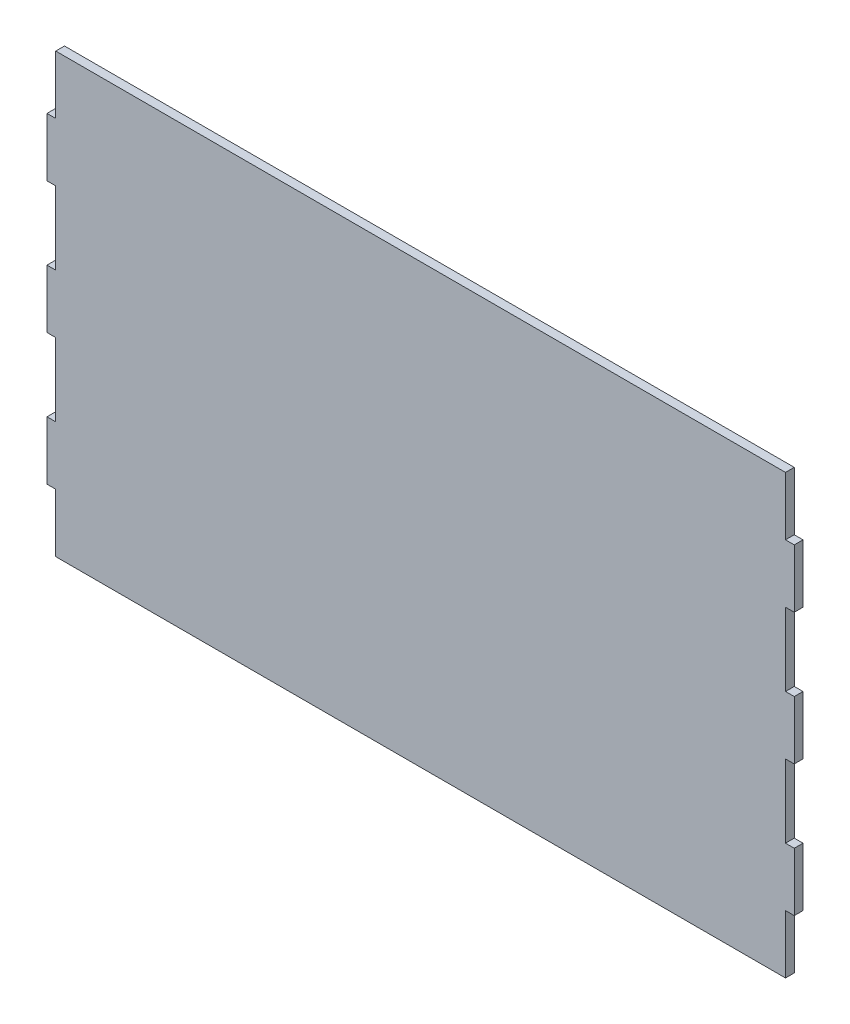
ISO-10303-21;
HEADER;
FILE_DESCRIPTION(('STEP AP214'),'2;1');
FILE_NAME('part.step','',(''),(''),'','','');
FILE_SCHEMA(('AUTOMOTIVE_DESIGN { 1 0 10303 214 1 1 1 1 }'));
ENDSEC;
DATA;
#1=APPLICATION_CONTEXT('core data for automotive mechanical design processes');
#2=APPLICATION_PROTOCOL_DEFINITION('international standard','automotive_design',2000,#1);
#3=PRODUCT_CONTEXT('',#1,'mechanical');
#4=PRODUCT('Part','Part','',(#3));
#5=PRODUCT_RELATED_PRODUCT_CATEGORY('part','',(#4));
#6=PRODUCT_DEFINITION_FORMATION('','',#4);
#7=PRODUCT_DEFINITION_CONTEXT('part definition',#1,'design');
#8=PRODUCT_DEFINITION('design','',#6,#7);
#9=PRODUCT_DEFINITION_SHAPE('','',#8);
#10=(LENGTH_UNIT() NAMED_UNIT(*) SI_UNIT(.MILLI.,.METRE.));
#11=(NAMED_UNIT(*) PLANE_ANGLE_UNIT() SI_UNIT($,.RADIAN.));
#12=(NAMED_UNIT(*) SI_UNIT($,.STERADIAN.) SOLID_ANGLE_UNIT());
#13=UNCERTAINTY_MEASURE_WITH_UNIT(LENGTH_MEASURE(1.E-05),#10,'distance_accuracy_value','');
#14=(GEOMETRIC_REPRESENTATION_CONTEXT(3) GLOBAL_UNCERTAINTY_ASSIGNED_CONTEXT((#13)) GLOBAL_UNIT_ASSIGNED_CONTEXT((#10,
#11,#12)) REPRESENTATION_CONTEXT('',''));
#15=CARTESIAN_POINT('',(0.,0.,0.));
#16=DIRECTION('',(0.,0.,1.));
#17=DIRECTION('',(1.,0.,0.));
#18=AXIS2_PLACEMENT_3D('',#15,#16,#17);
#19=CARTESIAN_POINT('',(-500.,140.,12.));
#20=DIRECTION('',(1.,0.,0.));
#21=DIRECTION('',(0.,1.,0.));
#22=AXIS2_PLACEMENT_3D('',#19,#20,#21);
#23=PLANE('',#22);
#24=DIRECTION('',(0.,-1.,0.));
#25=VECTOR('',#24,1.);
#26=CARTESIAN_POINT('',(-500.,140.,0.));
#27=LINE('',#26,#25);
#28=CARTESIAN_POINT('',(-500.,220.,0.));
#29=VERTEX_POINT('',#28);
#30=CARTESIAN_POINT('',(-500.,140.,0.));
#31=VERTEX_POINT('',#30);
#32=EDGE_CURVE('E257',#29,#31,#27,.T.);
#33=ORIENTED_EDGE('',*,*,#32,.T.);
#34=DIRECTION('',(0.,0.,-1.));
#35=VECTOR('',#34,1.);
#36=CARTESIAN_POINT('',(-500.,140.,12.));
#37=LINE('',#36,#35);
#38=CARTESIAN_POINT('',(-500.,140.,12.));
#39=VERTEX_POINT('',#38);
#40=EDGE_CURVE('E11',#39,#31,#37,.T.);
#41=ORIENTED_EDGE('',*,*,#40,.F.);
#42=DIRECTION('',(0.,-1.,0.));
#43=VECTOR('',#42,1.);
#44=CARTESIAN_POINT('',(-500.,140.,12.));
#45=LINE('',#44,#43);
#46=CARTESIAN_POINT('',(-500.,220.,12.));
#47=VERTEX_POINT('',#46);
#48=EDGE_CURVE('E311',#47,#39,#45,.T.);
#49=ORIENTED_EDGE('',*,*,#48,.F.);
#50=DIRECTION('',(0.,0.,-1.));
#51=VECTOR('',#50,1.);
#52=CARTESIAN_POINT('',(-500.,220.,12.));
#53=LINE('',#52,#51);
#54=EDGE_CURVE('E253',#47,#29,#53,.T.);
#55=ORIENTED_EDGE('',*,*,#54,.T.);
#56=EDGE_LOOP('',(#33,#41,#49,#55));
#57=FACE_BOUND('',#56,.T.);
#58=ADVANCED_FACE('F41',(#57),#23,.F.);
#59=CARTESIAN_POINT('',(-500.,140.,12.));
#60=DIRECTION('',(0.,-1.,0.));
#61=DIRECTION('',(1.,0.,0.));
#62=AXIS2_PLACEMENT_3D('',#59,#60,#61);
#63=PLANE('',#62);
#64=DIRECTION('',(-1.,0.,0.));
#65=VECTOR('',#64,1.);
#66=CARTESIAN_POINT('',(-500.,140.,0.));
#67=LINE('',#66,#65);
#68=CARTESIAN_POINT('',(-512.,140.,0.));
#69=VERTEX_POINT('',#68);
#70=EDGE_CURVE('E260',#31,#69,#67,.T.);
#71=ORIENTED_EDGE('',*,*,#70,.T.);
#72=DIRECTION('',(0.,0.,-1.));
#73=VECTOR('',#72,1.);
#74=CARTESIAN_POINT('',(-512.,140.,12.));
#75=LINE('',#74,#73);
#76=CARTESIAN_POINT('',(-512.,140.,12.));
#77=VERTEX_POINT('',#76);
#78=EDGE_CURVE('E49',#77,#69,#75,.T.);
#79=ORIENTED_EDGE('',*,*,#78,.F.);
#80=DIRECTION('',(-1.,0.,0.));
#81=VECTOR('',#80,1.);
#82=CARTESIAN_POINT('',(-500.,140.,12.));
#83=LINE('',#82,#81);
#84=EDGE_CURVE('E160',#39,#77,#83,.T.);
#85=ORIENTED_EDGE('',*,*,#84,.F.);
#86=ORIENTED_EDGE('',*,*,#40,.T.);
#87=EDGE_LOOP('',(#71,#79,#85,#86));
#88=FACE_BOUND('',#87,.T.);
#89=ADVANCED_FACE('F469',(#88),#63,.F.);
#90=CARTESIAN_POINT('',(-512.,140.,12.));
#91=DIRECTION('',(1.,0.,0.));
#92=DIRECTION('',(0.,0.,-1.));
#93=AXIS2_PLACEMENT_3D('',#90,#91,#92);
#94=PLANE('',#93);
#95=DIRECTION('',(0.,-1.,0.));
#96=VECTOR('',#95,1.);
#97=CARTESIAN_POINT('',(-512.,140.,0.));
#98=LINE('',#97,#96);
#99=CARTESIAN_POINT('',(-512.,60.,0.));
#100=VERTEX_POINT('',#99);
#101=EDGE_CURVE('E262',#69,#100,#98,.T.);
#102=ORIENTED_EDGE('',*,*,#101,.T.);
#103=DIRECTION('',(0.,0.,-1.));
#104=VECTOR('',#103,1.);
#105=CARTESIAN_POINT('',(-512.,60.,12.));
#106=LINE('',#105,#104);
#107=CARTESIAN_POINT('',(-512.,60.,12.));
#108=VERTEX_POINT('',#107);
#109=EDGE_CURVE('E378',#108,#100,#106,.T.);
#110=ORIENTED_EDGE('',*,*,#109,.F.);
#111=DIRECTION('',(0.,-1.,0.));
#112=VECTOR('',#111,1.);
#113=CARTESIAN_POINT('',(-512.,140.,12.));
#114=LINE('',#113,#112);
#115=EDGE_CURVE('E386',#77,#108,#114,.T.);
#116=ORIENTED_EDGE('',*,*,#115,.F.);
#117=ORIENTED_EDGE('',*,*,#78,.T.);
#118=EDGE_LOOP('',(#102,#110,#116,#117));
#119=FACE_BOUND('',#118,.T.);
#120=ADVANCED_FACE('F384',(#119),#94,.F.);
#121=CARTESIAN_POINT('',(-512.,60.,12.));
#122=DIRECTION('',(0.,1.,0.));
#123=DIRECTION('',(-1.,0.,0.));
#124=AXIS2_PLACEMENT_3D('',#121,#122,#123);
#125=PLANE('',#124);
#126=DIRECTION('',(1.,0.,0.));
#127=VECTOR('',#126,1.);
#128=CARTESIAN_POINT('',(-512.,60.,0.));
#129=LINE('',#128,#127);
#130=CARTESIAN_POINT('',(-500.,60.,0.));
#131=VERTEX_POINT('',#130);
#132=EDGE_CURVE('E264',#100,#131,#129,.T.);
#133=ORIENTED_EDGE('',*,*,#132,.T.);
#134=DIRECTION('',(0.,0.,-1.));
#135=VECTOR('',#134,1.);
#136=CARTESIAN_POINT('',(-500.,60.,12.));
#137=LINE('',#136,#135);
#138=CARTESIAN_POINT('',(-500.,60.,12.));
#139=VERTEX_POINT('',#138);
#140=EDGE_CURVE('E375',#139,#131,#137,.T.);
#141=ORIENTED_EDGE('',*,*,#140,.F.);
#142=DIRECTION('',(1.,0.,0.));
#143=VECTOR('',#142,1.);
#144=CARTESIAN_POINT('',(-512.,60.,12.));
#145=LINE('',#144,#143);
#146=EDGE_CURVE('E404',#108,#139,#145,.T.);
#147=ORIENTED_EDGE('',*,*,#146,.F.);
#148=ORIENTED_EDGE('',*,*,#109,.T.);
#149=EDGE_LOOP('',(#133,#141,#147,#148));
#150=FACE_BOUND('',#149,.T.);
#151=ADVANCED_FACE('F395',(#150),#125,.F.);
#152=CARTESIAN_POINT('',(-500.,-40.0000000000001,12.));
#153=DIRECTION('',(1.,0.,0.));
#154=DIRECTION('',(0.,1.,0.));
#155=AXIS2_PLACEMENT_3D('',#152,#153,#154);
#156=PLANE('',#155);
#157=DIRECTION('',(0.,-1.,0.));
#158=VECTOR('',#157,1.);
#159=CARTESIAN_POINT('',(-500.,-40.0000000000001,0.));
#160=LINE('',#159,#158);
#161=CARTESIAN_POINT('',(-500.,-40.0000000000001,0.));
#162=VERTEX_POINT('',#161);
#163=EDGE_CURVE('E266',#131,#162,#160,.T.);
#164=ORIENTED_EDGE('',*,*,#163,.T.);
#165=DIRECTION('',(0.,0.,-1.));
#166=VECTOR('',#165,1.);
#167=CARTESIAN_POINT('',(-500.,-40.0000000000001,12.));
#168=LINE('',#167,#166);
#169=CARTESIAN_POINT('',(-500.,-40.0000000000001,12.));
#170=VERTEX_POINT('',#169);
#171=EDGE_CURVE('E372',#170,#162,#168,.T.);
#172=ORIENTED_EDGE('',*,*,#171,.F.);
#173=DIRECTION('',(0.,-1.,0.));
#174=VECTOR('',#173,1.);
#175=CARTESIAN_POINT('',(-500.,-40.0000000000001,12.));
#176=LINE('',#175,#174);
#177=EDGE_CURVE('E401',#139,#170,#176,.T.);
#178=ORIENTED_EDGE('',*,*,#177,.F.);
#179=ORIENTED_EDGE('',*,*,#140,.T.);
#180=EDGE_LOOP('',(#164,#172,#178,#179));
#181=FACE_BOUND('',#180,.T.);
#182=ADVANCED_FACE('F399',(#181),#156,.F.);
#183=CARTESIAN_POINT('',(-500.,-40.0000000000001,12.));
#184=DIRECTION('',(0.,-1.,0.));
#185=DIRECTION('',(1.,0.,0.));
#186=AXIS2_PLACEMENT_3D('',#183,#184,#185);
#187=PLANE('',#186);
#188=DIRECTION('',(-1.,0.,0.));
#189=VECTOR('',#188,1.);
#190=CARTESIAN_POINT('',(-500.,-40.0000000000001,0.));
#191=LINE('',#190,#189);
#192=CARTESIAN_POINT('',(-512.,-40.0000000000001,0.));
#193=VERTEX_POINT('',#192);
#194=EDGE_CURVE('E268',#162,#193,#191,.T.);
#195=ORIENTED_EDGE('',*,*,#194,.T.);
#196=DIRECTION('',(0.,0.,-1.));
#197=VECTOR('',#196,1.);
#198=CARTESIAN_POINT('',(-512.,-40.0000000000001,12.));
#199=LINE('',#198,#197);
#200=CARTESIAN_POINT('',(-512.,-40.0000000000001,12.));
#201=VERTEX_POINT('',#200);
#202=EDGE_CURVE('E369',#201,#193,#199,.T.);
#203=ORIENTED_EDGE('',*,*,#202,.F.);
#204=DIRECTION('',(-1.,0.,0.));
#205=VECTOR('',#204,1.);
#206=CARTESIAN_POINT('',(-500.,-40.0000000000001,12.));
#207=LINE('',#206,#205);
#208=EDGE_CURVE('E403',#170,#201,#207,.T.);
#209=ORIENTED_EDGE('',*,*,#208,.F.);
#210=ORIENTED_EDGE('',*,*,#171,.T.);
#211=EDGE_LOOP('',(#195,#203,#209,#210));
#212=FACE_BOUND('',#211,.T.);
#213=ADVANCED_FACE('F482',(#212),#187,.F.);
#214=CARTESIAN_POINT('',(-512.,-40.0000000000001,12.));
#215=DIRECTION('',(1.,0.,0.));
#216=DIRECTION('',(0.,0.,-1.));
#217=AXIS2_PLACEMENT_3D('',#214,#215,#216);
#218=PLANE('',#217);
#219=DIRECTION('',(0.,-1.,0.));
#220=VECTOR('',#219,1.);
#221=CARTESIAN_POINT('',(-512.,-40.0000000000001,0.));
#222=LINE('',#221,#220);
#223=CARTESIAN_POINT('',(-512.,-120.,0.));
#224=VERTEX_POINT('',#223);
#225=EDGE_CURVE('E270',#193,#224,#222,.T.);
#226=ORIENTED_EDGE('',*,*,#225,.T.);
#227=DIRECTION('',(0.,0.,-1.));
#228=VECTOR('',#227,1.);
#229=CARTESIAN_POINT('',(-512.,-120.,12.));
#230=LINE('',#229,#228);
#231=CARTESIAN_POINT('',(-512.,-120.,12.));
#232=VERTEX_POINT('',#231);
#233=EDGE_CURVE('E366',#232,#224,#230,.T.);
#234=ORIENTED_EDGE('',*,*,#233,.F.);
#235=DIRECTION('',(0.,-1.,0.));
#236=VECTOR('',#235,1.);
#237=CARTESIAN_POINT('',(-512.,-40.0000000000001,12.));
#238=LINE('',#237,#236);
#239=EDGE_CURVE('E406',#201,#232,#238,.T.);
#240=ORIENTED_EDGE('',*,*,#239,.F.);
#241=ORIENTED_EDGE('',*,*,#202,.T.);
#242=EDGE_LOOP('',(#226,#234,#240,#241));
#243=FACE_BOUND('',#242,.T.);
#244=ADVANCED_FACE('F485',(#243),#218,.F.);
#245=CARTESIAN_POINT('',(-512.,-120.,12.));
#246=DIRECTION('',(0.,1.,0.));
#247=DIRECTION('',(-1.,0.,0.));
#248=AXIS2_PLACEMENT_3D('',#245,#246,#247);
#249=PLANE('',#248);
#250=DIRECTION('',(1.,0.,0.));
#251=VECTOR('',#250,1.);
#252=CARTESIAN_POINT('',(-512.,-120.,0.));
#253=LINE('',#252,#251);
#254=CARTESIAN_POINT('',(-500.,-120.,0.));
#255=VERTEX_POINT('',#254);
#256=EDGE_CURVE('E272',#224,#255,#253,.T.);
#257=ORIENTED_EDGE('',*,*,#256,.T.);
#258=DIRECTION('',(0.,0.,-1.));
#259=VECTOR('',#258,1.);
#260=CARTESIAN_POINT('',(-500.,-120.,12.));
#261=LINE('',#260,#259);
#262=CARTESIAN_POINT('',(-500.,-120.,12.));
#263=VERTEX_POINT('',#262);
#264=EDGE_CURVE('E363',#263,#255,#261,.T.);
#265=ORIENTED_EDGE('',*,*,#264,.F.);
#266=DIRECTION('',(1.,0.,0.));
#267=VECTOR('',#266,1.);
#268=CARTESIAN_POINT('',(-512.,-120.,12.));
#269=LINE('',#268,#267);
#270=EDGE_CURVE('E412',#232,#263,#269,.T.);
#271=ORIENTED_EDGE('',*,*,#270,.F.);
#272=ORIENTED_EDGE('',*,*,#233,.T.);
#273=EDGE_LOOP('',(#257,#265,#271,#272));
#274=FACE_BOUND('',#273,.T.);
#275=ADVANCED_FACE('F489',(#274),#249,.F.);
#276=CARTESIAN_POINT('',(-500.,-220.,12.));
#277=DIRECTION('',(1.,0.,0.));
#278=DIRECTION('',(0.,1.,0.));
#279=AXIS2_PLACEMENT_3D('',#276,#277,#278);
#280=PLANE('',#279);
#281=DIRECTION('',(0.,-1.,0.));
#282=VECTOR('',#281,1.);
#283=CARTESIAN_POINT('',(-500.,-220.,0.));
#284=LINE('',#283,#282);
#285=CARTESIAN_POINT('',(-500.,-220.,0.));
#286=VERTEX_POINT('',#285);
#287=EDGE_CURVE('E274',#255,#286,#284,.T.);
#288=ORIENTED_EDGE('',*,*,#287,.T.);
#289=DIRECTION('',(0.,0.,-1.));
#290=VECTOR('',#289,1.);
#291=CARTESIAN_POINT('',(-500.,-220.,12.));
#292=LINE('',#291,#290);
#293=CARTESIAN_POINT('',(-500.,-220.,12.));
#294=VERTEX_POINT('',#293);
#295=EDGE_CURVE('E360',#294,#286,#292,.T.);
#296=ORIENTED_EDGE('',*,*,#295,.F.);
#297=DIRECTION('',(0.,-1.,0.));
#298=VECTOR('',#297,1.);
#299=CARTESIAN_POINT('',(-500.,-220.,12.));
#300=LINE('',#299,#298);
#301=EDGE_CURVE('E414',#263,#294,#300,.T.);
#302=ORIENTED_EDGE('',*,*,#301,.F.);
#303=ORIENTED_EDGE('',*,*,#264,.T.);
#304=EDGE_LOOP('',(#288,#296,#302,#303));
#305=FACE_BOUND('',#304,.T.);
#306=ADVANCED_FACE('F493',(#305),#280,.F.);
#307=CARTESIAN_POINT('',(-500.,-220.,12.));
#308=DIRECTION('',(0.,-1.,0.));
#309=DIRECTION('',(0.,0.,-1.));
#310=AXIS2_PLACEMENT_3D('',#307,#308,#309);
#311=PLANE('',#310);
#312=DIRECTION('',(-1.,0.,0.));
#313=VECTOR('',#312,1.);
#314=CARTESIAN_POINT('',(-500.,-220.,0.));
#315=LINE('',#314,#313);
#316=CARTESIAN_POINT('',(-512.,-220.,0.));
#317=VERTEX_POINT('',#316);
#318=EDGE_CURVE('E276',#286,#317,#315,.T.);
#319=ORIENTED_EDGE('',*,*,#318,.T.);
#320=DIRECTION('',(0.,0.,-1.));
#321=VECTOR('',#320,1.);
#322=CARTESIAN_POINT('',(-512.,-220.,12.));
#323=LINE('',#322,#321);
#324=CARTESIAN_POINT('',(-512.,-220.,12.));
#325=VERTEX_POINT('',#324);
#326=EDGE_CURVE('E357',#325,#317,#323,.T.);
#327=ORIENTED_EDGE('',*,*,#326,.F.);
#328=DIRECTION('',(-1.,0.,0.));
#329=VECTOR('',#328,1.);
#330=CARTESIAN_POINT('',(-500.,-220.,12.));
#331=LINE('',#330,#329);
#332=EDGE_CURVE('E416',#294,#325,#331,.T.);
#333=ORIENTED_EDGE('',*,*,#332,.F.);
#334=ORIENTED_EDGE('',*,*,#295,.T.);
#335=EDGE_LOOP('',(#319,#327,#333,#334));
#336=FACE_BOUND('',#335,.T.);
#337=ADVANCED_FACE('F497',(#336),#311,.F.);
#338=CARTESIAN_POINT('',(-512.,-220.,12.));
#339=DIRECTION('',(1.,0.,0.));
#340=DIRECTION('',(0.,0.,-1.));
#341=AXIS2_PLACEMENT_3D('',#338,#339,#340);
#342=PLANE('',#341);
#343=DIRECTION('',(0.,-1.,0.));
#344=VECTOR('',#343,1.);
#345=CARTESIAN_POINT('',(-512.,-220.,0.));
#346=LINE('',#345,#344);
#347=CARTESIAN_POINT('',(-512.,-300.,0.));
#348=VERTEX_POINT('',#347);
#349=EDGE_CURVE('E278',#317,#348,#346,.T.);
#350=ORIENTED_EDGE('',*,*,#349,.T.);
#351=DIRECTION('',(0.,0.,-1.));
#352=VECTOR('',#351,1.);
#353=CARTESIAN_POINT('',(-512.,-300.,12.));
#354=LINE('',#353,#352);
#355=CARTESIAN_POINT('',(-512.,-300.,12.));
#356=VERTEX_POINT('',#355);
#357=EDGE_CURVE('E354',#356,#348,#354,.T.);
#358=ORIENTED_EDGE('',*,*,#357,.F.);
#359=DIRECTION('',(0.,-1.,0.));
#360=VECTOR('',#359,1.);
#361=CARTESIAN_POINT('',(-512.,-220.,12.));
#362=LINE('',#361,#360);
#363=EDGE_CURVE('E418',#325,#356,#362,.T.);
#364=ORIENTED_EDGE('',*,*,#363,.F.);
#365=ORIENTED_EDGE('',*,*,#326,.T.);
#366=EDGE_LOOP('',(#350,#358,#364,#365));
#367=FACE_BOUND('',#366,.T.);
#368=ADVANCED_FACE('F501',(#367),#342,.F.);
#369=CARTESIAN_POINT('',(-512.,-300.,12.));
#370=DIRECTION('',(0.,1.,0.));
#371=DIRECTION('',(0.,0.,1.));
#372=AXIS2_PLACEMENT_3D('',#369,#370,#371);
#373=PLANE('',#372);
#374=DIRECTION('',(1.,0.,0.));
#375=VECTOR('',#374,1.);
#376=CARTESIAN_POINT('',(-512.,-300.,0.));
#377=LINE('',#376,#375);
#378=CARTESIAN_POINT('',(-500.,-300.,0.));
#379=VERTEX_POINT('',#378);
#380=EDGE_CURVE('E280',#348,#379,#377,.T.);
#381=ORIENTED_EDGE('',*,*,#380,.T.);
#382=DIRECTION('',(0.,0.,-1.));
#383=VECTOR('',#382,1.);
#384=CARTESIAN_POINT('',(-500.,-300.,12.));
#385=LINE('',#384,#383);
#386=CARTESIAN_POINT('',(-500.,-300.,12.));
#387=VERTEX_POINT('',#386);
#388=EDGE_CURVE('E351',#387,#379,#385,.T.);
#389=ORIENTED_EDGE('',*,*,#388,.F.);
#390=DIRECTION('',(1.,0.,0.));
#391=VECTOR('',#390,1.);
#392=CARTESIAN_POINT('',(-512.,-300.,12.));
#393=LINE('',#392,#391);
#394=EDGE_CURVE('E420',#356,#387,#393,.T.);
#395=ORIENTED_EDGE('',*,*,#394,.F.);
#396=ORIENTED_EDGE('',*,*,#357,.T.);
#397=EDGE_LOOP('',(#381,#389,#395,#396));
#398=FACE_BOUND('',#397,.T.);
#399=ADVANCED_FACE('F505',(#398),#373,.F.);
#400=CARTESIAN_POINT('',(-500.,-380.,12.));
#401=DIRECTION('',(1.,0.,0.));
#402=DIRECTION('',(0.,1.,0.));
#403=AXIS2_PLACEMENT_3D('',#400,#401,#402);
#404=PLANE('',#403);
#405=DIRECTION('',(0.,-1.,0.));
#406=VECTOR('',#405,1.);
#407=CARTESIAN_POINT('',(-500.,-380.,0.));
#408=LINE('',#407,#406);
#409=CARTESIAN_POINT('',(-500.,-380.,0.));
#410=VERTEX_POINT('',#409);
#411=EDGE_CURVE('E282',#379,#410,#408,.T.);
#412=ORIENTED_EDGE('',*,*,#411,.T.);
#413=DIRECTION('',(0.,0.,-1.));
#414=VECTOR('',#413,1.);
#415=CARTESIAN_POINT('',(-500.,-380.,12.));
#416=LINE('',#415,#414);
#417=CARTESIAN_POINT('',(-500.,-380.,12.));
#418=VERTEX_POINT('',#417);
#419=EDGE_CURVE('E348',#418,#410,#416,.T.);
#420=ORIENTED_EDGE('',*,*,#419,.F.);
#421=DIRECTION('',(0.,-1.,0.));
#422=VECTOR('',#421,1.);
#423=CARTESIAN_POINT('',(-500.,-380.,12.));
#424=LINE('',#423,#422);
#425=EDGE_CURVE('E422',#387,#418,#424,.T.);
#426=ORIENTED_EDGE('',*,*,#425,.F.);
#427=ORIENTED_EDGE('',*,*,#388,.T.);
#428=EDGE_LOOP('',(#412,#420,#426,#427));
#429=FACE_BOUND('',#428,.T.);
#430=ADVANCED_FACE('F509',(#429),#404,.F.);
#431=CARTESIAN_POINT('',(500.,-380.,12.));
#432=DIRECTION('',(0.,1.,0.));
#433=DIRECTION('',(-1.,0.,0.));
#434=AXIS2_PLACEMENT_3D('',#431,#432,#433);
#435=PLANE('',#434);
#436=DIRECTION('',(1.,0.,0.));
#437=VECTOR('',#436,1.);
#438=CARTESIAN_POINT('',(500.,-380.,0.));
#439=LINE('',#438,#437);
#440=CARTESIAN_POINT('',(500.,-380.,0.));
#441=VERTEX_POINT('',#440);
#442=EDGE_CURVE('E284',#410,#441,#439,.T.);
#443=ORIENTED_EDGE('',*,*,#442,.T.);
#444=DIRECTION('',(0.,0.,-1.));
#445=VECTOR('',#444,1.);
#446=CARTESIAN_POINT('',(500.,-380.,12.));
#447=LINE('',#446,#445);
#448=CARTESIAN_POINT('',(500.,-380.,12.));
#449=VERTEX_POINT('',#448);
#450=EDGE_CURVE('E345',#449,#441,#447,.T.);
#451=ORIENTED_EDGE('',*,*,#450,.F.);
#452=DIRECTION('',(1.,0.,0.));
#453=VECTOR('',#452,1.);
#454=CARTESIAN_POINT('',(500.,-380.,12.));
#455=LINE('',#454,#453);
#456=EDGE_CURVE('E424',#418,#449,#455,.T.);
#457=ORIENTED_EDGE('',*,*,#456,.F.);
#458=ORIENTED_EDGE('',*,*,#419,.T.);
#459=EDGE_LOOP('',(#443,#451,#457,#458));
#460=FACE_BOUND('',#459,.T.);
#461=ADVANCED_FACE('F513',(#460),#435,.F.);
#462=CARTESIAN_POINT('',(500.,-380.,12.));
#463=DIRECTION('',(-1.,0.,0.));
#464=DIRECTION('',(0.,-1.,0.));
#465=AXIS2_PLACEMENT_3D('',#462,#463,#464);
#466=PLANE('',#465);
#467=DIRECTION('',(0.,1.,0.));
#468=VECTOR('',#467,1.);
#469=CARTESIAN_POINT('',(500.,-380.,0.));
#470=LINE('',#469,#468);
#471=CARTESIAN_POINT('',(500.,-300.,0.));
#472=VERTEX_POINT('',#471);
#473=EDGE_CURVE('E286',#441,#472,#470,.T.);
#474=ORIENTED_EDGE('',*,*,#473,.T.);
#475=DIRECTION('',(0.,0.,-1.));
#476=VECTOR('',#475,1.);
#477=CARTESIAN_POINT('',(500.,-300.,12.));
#478=LINE('',#477,#476);
#479=CARTESIAN_POINT('',(500.,-300.,12.));
#480=VERTEX_POINT('',#479);
#481=EDGE_CURVE('E342',#480,#472,#478,.T.);
#482=ORIENTED_EDGE('',*,*,#481,.F.);
#483=DIRECTION('',(0.,1.,0.));
#484=VECTOR('',#483,1.);
#485=CARTESIAN_POINT('',(500.,-380.,12.));
#486=LINE('',#485,#484);
#487=EDGE_CURVE('E426',#449,#480,#486,.T.);
#488=ORIENTED_EDGE('',*,*,#487,.F.);
#489=ORIENTED_EDGE('',*,*,#450,.T.);
#490=EDGE_LOOP('',(#474,#482,#488,#489));
#491=FACE_BOUND('',#490,.T.);
#492=ADVANCED_FACE('F517',(#491),#466,.F.);
#493=CARTESIAN_POINT('',(512.,-300.,12.));
#494=DIRECTION('',(0.,1.,0.));
#495=DIRECTION('',(-1.,0.,0.));
#496=AXIS2_PLACEMENT_3D('',#493,#494,#495);
#497=PLANE('',#496);
#498=DIRECTION('',(1.,0.,0.));
#499=VECTOR('',#498,1.);
#500=CARTESIAN_POINT('',(512.,-300.,0.));
#501=LINE('',#500,#499);
#502=CARTESIAN_POINT('',(512.,-300.,0.));
#503=VERTEX_POINT('',#502);
#504=EDGE_CURVE('E288',#472,#503,#501,.T.);
#505=ORIENTED_EDGE('',*,*,#504,.T.);
#506=DIRECTION('',(0.,0.,-1.));
#507=VECTOR('',#506,1.);
#508=CARTESIAN_POINT('',(512.,-300.,12.));
#509=LINE('',#508,#507);
#510=CARTESIAN_POINT('',(512.,-300.,12.));
#511=VERTEX_POINT('',#510);
#512=EDGE_CURVE('E339',#511,#503,#509,.T.);
#513=ORIENTED_EDGE('',*,*,#512,.F.);
#514=DIRECTION('',(1.,0.,0.));
#515=VECTOR('',#514,1.);
#516=CARTESIAN_POINT('',(512.,-300.,12.));
#517=LINE('',#516,#515);
#518=EDGE_CURVE('E428',#480,#511,#517,.T.);
#519=ORIENTED_EDGE('',*,*,#518,.F.);
#520=ORIENTED_EDGE('',*,*,#481,.T.);
#521=EDGE_LOOP('',(#505,#513,#519,#520));
#522=FACE_BOUND('',#521,.T.);
#523=ADVANCED_FACE('F521',(#522),#497,.F.);
#524=CARTESIAN_POINT('',(512.,-220.,12.));
#525=DIRECTION('',(-1.,0.,0.));
#526=DIRECTION('',(0.,0.,1.));
#527=AXIS2_PLACEMENT_3D('',#524,#525,#526);
#528=PLANE('',#527);
#529=DIRECTION('',(0.,1.,0.));
#530=VECTOR('',#529,1.);
#531=CARTESIAN_POINT('',(512.,-220.,0.));
#532=LINE('',#531,#530);
#533=CARTESIAN_POINT('',(512.,-220.,0.));
#534=VERTEX_POINT('',#533);
#535=EDGE_CURVE('E290',#503,#534,#532,.T.);
#536=ORIENTED_EDGE('',*,*,#535,.T.);
#537=DIRECTION('',(0.,0.,-1.));
#538=VECTOR('',#537,1.);
#539=CARTESIAN_POINT('',(512.,-220.,12.));
#540=LINE('',#539,#538);
#541=CARTESIAN_POINT('',(512.,-220.,12.));
#542=VERTEX_POINT('',#541);
#543=EDGE_CURVE('E336',#542,#534,#540,.T.);
#544=ORIENTED_EDGE('',*,*,#543,.F.);
#545=DIRECTION('',(0.,1.,0.));
#546=VECTOR('',#545,1.);
#547=CARTESIAN_POINT('',(512.,-220.,12.));
#548=LINE('',#547,#546);
#549=EDGE_CURVE('E430',#511,#542,#548,.T.);
#550=ORIENTED_EDGE('',*,*,#549,.F.);
#551=ORIENTED_EDGE('',*,*,#512,.T.);
#552=EDGE_LOOP('',(#536,#544,#550,#551));
#553=FACE_BOUND('',#552,.T.);
#554=ADVANCED_FACE('F525',(#553),#528,.F.);
#555=CARTESIAN_POINT('',(500.,-220.,12.));
#556=DIRECTION('',(0.,-1.,0.));
#557=DIRECTION('',(1.,0.,0.));
#558=AXIS2_PLACEMENT_3D('',#555,#556,#557);
#559=PLANE('',#558);
#560=DIRECTION('',(-1.,0.,0.));
#561=VECTOR('',#560,1.);
#562=CARTESIAN_POINT('',(500.,-220.,0.));
#563=LINE('',#562,#561);
#564=CARTESIAN_POINT('',(500.,-220.,0.));
#565=VERTEX_POINT('',#564);
#566=EDGE_CURVE('E292',#534,#565,#563,.T.);
#567=ORIENTED_EDGE('',*,*,#566,.T.);
#568=DIRECTION('',(0.,0.,-1.));
#569=VECTOR('',#568,1.);
#570=CARTESIAN_POINT('',(500.,-220.,12.));
#571=LINE('',#570,#569);
#572=CARTESIAN_POINT('',(500.,-220.,12.));
#573=VERTEX_POINT('',#572);
#574=EDGE_CURVE('E333',#573,#565,#571,.T.);
#575=ORIENTED_EDGE('',*,*,#574,.F.);
#576=DIRECTION('',(-1.,0.,0.));
#577=VECTOR('',#576,1.);
#578=CARTESIAN_POINT('',(500.,-220.,12.));
#579=LINE('',#578,#577);
#580=EDGE_CURVE('E432',#542,#573,#579,.T.);
#581=ORIENTED_EDGE('',*,*,#580,.F.);
#582=ORIENTED_EDGE('',*,*,#543,.T.);
#583=EDGE_LOOP('',(#567,#575,#581,#582));
#584=FACE_BOUND('',#583,.T.);
#585=ADVANCED_FACE('F529',(#584),#559,.F.);
#586=CARTESIAN_POINT('',(500.,-220.,12.));
#587=DIRECTION('',(-1.,0.,0.));
#588=DIRECTION('',(0.,-1.,0.));
#589=AXIS2_PLACEMENT_3D('',#586,#587,#588);
#590=PLANE('',#589);
#591=DIRECTION('',(0.,1.,0.));
#592=VECTOR('',#591,1.);
#593=CARTESIAN_POINT('',(500.,-220.,0.));
#594=LINE('',#593,#592);
#595=CARTESIAN_POINT('',(500.,-120.,0.));
#596=VERTEX_POINT('',#595);
#597=EDGE_CURVE('E294',#565,#596,#594,.T.);
#598=ORIENTED_EDGE('',*,*,#597,.T.);
#599=DIRECTION('',(0.,0.,-1.));
#600=VECTOR('',#599,1.);
#601=CARTESIAN_POINT('',(500.,-120.,12.));
#602=LINE('',#601,#600);
#603=CARTESIAN_POINT('',(500.,-120.,12.));
#604=VERTEX_POINT('',#603);
#605=EDGE_CURVE('E330',#604,#596,#602,.T.);
#606=ORIENTED_EDGE('',*,*,#605,.F.);
#607=DIRECTION('',(0.,1.,0.));
#608=VECTOR('',#607,1.);
#609=CARTESIAN_POINT('',(500.,-220.,12.));
#610=LINE('',#609,#608);
#611=EDGE_CURVE('E434',#573,#604,#610,.T.);
#612=ORIENTED_EDGE('',*,*,#611,.F.);
#613=ORIENTED_EDGE('',*,*,#574,.T.);
#614=EDGE_LOOP('',(#598,#606,#612,#613));
#615=FACE_BOUND('',#614,.T.);
#616=ADVANCED_FACE('F533',(#615),#590,.F.);
#617=CARTESIAN_POINT('',(512.,-120.,12.));
#618=DIRECTION('',(0.,1.,0.));
#619=DIRECTION('',(-1.,0.,0.));
#620=AXIS2_PLACEMENT_3D('',#617,#618,#619);
#621=PLANE('',#620);
#622=DIRECTION('',(1.,0.,0.));
#623=VECTOR('',#622,1.);
#624=CARTESIAN_POINT('',(512.,-120.,0.));
#625=LINE('',#624,#623);
#626=CARTESIAN_POINT('',(512.,-120.,0.));
#627=VERTEX_POINT('',#626);
#628=EDGE_CURVE('E296',#596,#627,#625,.T.);
#629=ORIENTED_EDGE('',*,*,#628,.T.);
#630=DIRECTION('',(0.,0.,-1.));
#631=VECTOR('',#630,1.);
#632=CARTESIAN_POINT('',(512.,-120.,12.));
#633=LINE('',#632,#631);
#634=CARTESIAN_POINT('',(512.,-120.,12.));
#635=VERTEX_POINT('',#634);
#636=EDGE_CURVE('E327',#635,#627,#633,.T.);
#637=ORIENTED_EDGE('',*,*,#636,.F.);
#638=DIRECTION('',(1.,0.,0.));
#639=VECTOR('',#638,1.);
#640=CARTESIAN_POINT('',(512.,-120.,12.));
#641=LINE('',#640,#639);
#642=EDGE_CURVE('E436',#604,#635,#641,.T.);
#643=ORIENTED_EDGE('',*,*,#642,.F.);
#644=ORIENTED_EDGE('',*,*,#605,.T.);
#645=EDGE_LOOP('',(#629,#637,#643,#644));
#646=FACE_BOUND('',#645,.T.);
#647=ADVANCED_FACE('F537',(#646),#621,.F.);
#648=CARTESIAN_POINT('',(512.,-39.9999999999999,12.));
#649=DIRECTION('',(-1.,0.,0.));
#650=DIRECTION('',(0.,0.,1.));
#651=AXIS2_PLACEMENT_3D('',#648,#649,#650);
#652=PLANE('',#651);
#653=DIRECTION('',(0.,1.,0.));
#654=VECTOR('',#653,1.);
#655=CARTESIAN_POINT('',(512.,-39.9999999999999,0.));
#656=LINE('',#655,#654);
#657=CARTESIAN_POINT('',(512.,-39.9999999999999,0.));
#658=VERTEX_POINT('',#657);
#659=EDGE_CURVE('E298',#627,#658,#656,.T.);
#660=ORIENTED_EDGE('',*,*,#659,.T.);
#661=DIRECTION('',(0.,0.,-1.));
#662=VECTOR('',#661,1.);
#663=CARTESIAN_POINT('',(512.,-39.9999999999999,12.));
#664=LINE('',#663,#662);
#665=CARTESIAN_POINT('',(512.,-39.9999999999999,12.));
#666=VERTEX_POINT('',#665);
#667=EDGE_CURVE('E324',#666,#658,#664,.T.);
#668=ORIENTED_EDGE('',*,*,#667,.F.);
#669=DIRECTION('',(0.,1.,0.));
#670=VECTOR('',#669,1.);
#671=CARTESIAN_POINT('',(512.,-39.9999999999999,12.));
#672=LINE('',#671,#670);
#673=EDGE_CURVE('E438',#635,#666,#672,.T.);
#674=ORIENTED_EDGE('',*,*,#673,.F.);
#675=ORIENTED_EDGE('',*,*,#636,.T.);
#676=EDGE_LOOP('',(#660,#668,#674,#675));
#677=FACE_BOUND('',#676,.T.);
#678=ADVANCED_FACE('F541',(#677),#652,.F.);
#679=CARTESIAN_POINT('',(500.,-40.,12.));
#680=DIRECTION('',(0.,-1.,0.));
#681=DIRECTION('',(1.,0.,0.));
#682=AXIS2_PLACEMENT_3D('',#679,#680,#681);
#683=PLANE('',#682);
#684=DIRECTION('',(-1.,0.,0.));
#685=VECTOR('',#684,1.);
#686=CARTESIAN_POINT('',(500.,-40.,0.));
#687=LINE('',#686,#685);
#688=CARTESIAN_POINT('',(500.,-40.,0.));
#689=VERTEX_POINT('',#688);
#690=EDGE_CURVE('E300',#658,#689,#687,.T.);
#691=ORIENTED_EDGE('',*,*,#690,.T.);
#692=DIRECTION('',(0.,0.,-1.));
#693=VECTOR('',#692,1.);
#694=CARTESIAN_POINT('',(500.,-40.,12.));
#695=LINE('',#694,#693);
#696=CARTESIAN_POINT('',(500.,-40.,12.));
#697=VERTEX_POINT('',#696);
#698=EDGE_CURVE('E321',#697,#689,#695,.T.);
#699=ORIENTED_EDGE('',*,*,#698,.F.);
#700=DIRECTION('',(-1.,0.,0.));
#701=VECTOR('',#700,1.);
#702=CARTESIAN_POINT('',(500.,-40.,12.));
#703=LINE('',#702,#701);
#704=EDGE_CURVE('E440',#666,#697,#703,.T.);
#705=ORIENTED_EDGE('',*,*,#704,.F.);
#706=ORIENTED_EDGE('',*,*,#667,.T.);
#707=EDGE_LOOP('',(#691,#699,#705,#706));
#708=FACE_BOUND('',#707,.T.);
#709=ADVANCED_FACE('F545',(#708),#683,.F.);
#710=CARTESIAN_POINT('',(500.,-40.,12.));
#711=DIRECTION('',(-1.,0.,0.));
#712=DIRECTION('',(0.,-1.,0.));
#713=AXIS2_PLACEMENT_3D('',#710,#711,#712);
#714=PLANE('',#713);
#715=DIRECTION('',(0.,1.,0.));
#716=VECTOR('',#715,1.);
#717=CARTESIAN_POINT('',(500.,-40.,0.));
#718=LINE('',#717,#716);
#719=CARTESIAN_POINT('',(500.,60.0000000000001,0.));
#720=VERTEX_POINT('',#719);
#721=EDGE_CURVE('E302',#689,#720,#718,.T.);
#722=ORIENTED_EDGE('',*,*,#721,.T.);
#723=DIRECTION('',(0.,0.,-1.));
#724=VECTOR('',#723,1.);
#725=CARTESIAN_POINT('',(500.,60.0000000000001,12.));
#726=LINE('',#725,#724);
#727=CARTESIAN_POINT('',(500.,60.0000000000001,12.));
#728=VERTEX_POINT('',#727);
#729=EDGE_CURVE('E318',#728,#720,#726,.T.);
#730=ORIENTED_EDGE('',*,*,#729,.F.);
#731=DIRECTION('',(0.,1.,0.));
#732=VECTOR('',#731,1.);
#733=CARTESIAN_POINT('',(500.,-40.,12.));
#734=LINE('',#733,#732);
#735=EDGE_CURVE('E442',#697,#728,#734,.T.);
#736=ORIENTED_EDGE('',*,*,#735,.F.);
#737=ORIENTED_EDGE('',*,*,#698,.T.);
#738=EDGE_LOOP('',(#722,#730,#736,#737));
#739=FACE_BOUND('',#738,.T.);
#740=ADVANCED_FACE('F549',(#739),#714,.F.);
#741=CARTESIAN_POINT('',(512.,60.0000000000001,12.));
#742=DIRECTION('',(0.,1.,0.));
#743=DIRECTION('',(-1.,0.,0.));
#744=AXIS2_PLACEMENT_3D('',#741,#742,#743);
#745=PLANE('',#744);
#746=DIRECTION('',(1.,0.,0.));
#747=VECTOR('',#746,1.);
#748=CARTESIAN_POINT('',(512.,60.0000000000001,0.));
#749=LINE('',#748,#747);
#750=CARTESIAN_POINT('',(512.,60.0000000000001,0.));
#751=VERTEX_POINT('',#750);
#752=EDGE_CURVE('E304',#720,#751,#749,.T.);
#753=ORIENTED_EDGE('',*,*,#752,.T.);
#754=DIRECTION('',(0.,0.,-1.));
#755=VECTOR('',#754,1.);
#756=CARTESIAN_POINT('',(512.,60.0000000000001,12.));
#757=LINE('',#756,#755);
#758=CARTESIAN_POINT('',(512.,60.0000000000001,12.));
#759=VERTEX_POINT('',#758);
#760=EDGE_CURVE('E315',#759,#751,#757,.T.);
#761=ORIENTED_EDGE('',*,*,#760,.F.);
#762=DIRECTION('',(1.,0.,0.));
#763=VECTOR('',#762,1.);
#764=CARTESIAN_POINT('',(512.,60.0000000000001,12.));
#765=LINE('',#764,#763);
#766=EDGE_CURVE('E444',#728,#759,#765,.T.);
#767=ORIENTED_EDGE('',*,*,#766,.F.);
#768=ORIENTED_EDGE('',*,*,#729,.T.);
#769=EDGE_LOOP('',(#753,#761,#767,#768));
#770=FACE_BOUND('',#769,.T.);
#771=ADVANCED_FACE('F450',(#770),#745,.F.);
#772=CARTESIAN_POINT('',(512.,140.,12.));
#773=DIRECTION('',(-1.,0.,0.));
#774=DIRECTION('',(0.,0.,1.));
#775=AXIS2_PLACEMENT_3D('',#772,#773,#774);
#776=PLANE('',#775);
#777=DIRECTION('',(0.,1.,0.));
#778=VECTOR('',#777,1.);
#779=CARTESIAN_POINT('',(512.,140.,0.));
#780=LINE('',#779,#778);
#781=CARTESIAN_POINT('',(512.,140.,0.));
#782=VERTEX_POINT('',#781);
#783=EDGE_CURVE('E306',#751,#782,#780,.T.);
#784=ORIENTED_EDGE('',*,*,#783,.T.);
#785=DIRECTION('',(0.,0.,-1.));
#786=VECTOR('',#785,1.);
#787=CARTESIAN_POINT('',(512.,140.,12.));
#788=LINE('',#787,#786);
#789=CARTESIAN_POINT('',(512.,140.,12.));
#790=VERTEX_POINT('',#789);
#791=EDGE_CURVE('E248',#790,#782,#788,.T.);
#792=ORIENTED_EDGE('',*,*,#791,.F.);
#793=DIRECTION('',(0.,1.,0.));
#794=VECTOR('',#793,1.);
#795=CARTESIAN_POINT('',(512.,140.,12.));
#796=LINE('',#795,#794);
#797=EDGE_CURVE('E239',#759,#790,#796,.T.);
#798=ORIENTED_EDGE('',*,*,#797,.F.);
#799=ORIENTED_EDGE('',*,*,#760,.T.);
#800=EDGE_LOOP('',(#784,#792,#798,#799));
#801=FACE_BOUND('',#800,.T.);
#802=ADVANCED_FACE('F454',(#801),#776,.F.);
#803=CARTESIAN_POINT('',(500.,140.,12.));
#804=DIRECTION('',(0.,-1.,0.));
#805=DIRECTION('',(1.,0.,0.));
#806=AXIS2_PLACEMENT_3D('',#803,#804,#805);
#807=PLANE('',#806);
#808=DIRECTION('',(-1.,0.,0.));
#809=VECTOR('',#808,1.);
#810=CARTESIAN_POINT('',(500.,140.,0.));
#811=LINE('',#810,#809);
#812=CARTESIAN_POINT('',(500.,140.,0.));
#813=VERTEX_POINT('',#812);
#814=EDGE_CURVE('E247',#782,#813,#811,.T.);
#815=ORIENTED_EDGE('',*,*,#814,.T.);
#816=DIRECTION('',(0.,0.,-1.));
#817=VECTOR('',#816,1.);
#818=CARTESIAN_POINT('',(500.,140.,12.));
#819=LINE('',#818,#817);
#820=CARTESIAN_POINT('',(500.,140.,12.));
#821=VERTEX_POINT('',#820);
#822=EDGE_CURVE('E244',#821,#813,#819,.T.);
#823=ORIENTED_EDGE('',*,*,#822,.F.);
#824=DIRECTION('',(-1.,0.,0.));
#825=VECTOR('',#824,1.);
#826=CARTESIAN_POINT('',(500.,140.,12.));
#827=LINE('',#826,#825);
#828=EDGE_CURVE('E233',#790,#821,#827,.T.);
#829=ORIENTED_EDGE('',*,*,#828,.F.);
#830=ORIENTED_EDGE('',*,*,#791,.T.);
#831=EDGE_LOOP('',(#815,#823,#829,#830));
#832=FACE_BOUND('',#831,.T.);
#833=ADVANCED_FACE('F245',(#832),#807,.F.);
#834=CARTESIAN_POINT('',(500.,140.,12.));
#835=DIRECTION('',(-1.,0.,0.));
#836=DIRECTION('',(0.,-1.,0.));
#837=AXIS2_PLACEMENT_3D('',#834,#835,#836);
#838=PLANE('',#837);
#839=DIRECTION('',(0.,1.,0.));
#840=VECTOR('',#839,1.);
#841=CARTESIAN_POINT('',(500.,140.,0.));
#842=LINE('',#841,#840);
#843=CARTESIAN_POINT('',(500.,220.,0.));
#844=VERTEX_POINT('',#843);
#845=EDGE_CURVE('E146',#813,#844,#842,.T.);
#846=ORIENTED_EDGE('',*,*,#845,.T.);
#847=DIRECTION('',(0.,0.,-1.));
#848=VECTOR('',#847,1.);
#849=CARTESIAN_POINT('',(500.,220.,12.));
#850=LINE('',#849,#848);
#851=CARTESIAN_POINT('',(500.,220.,12.));
#852=VERTEX_POINT('',#851);
#853=EDGE_CURVE('E249',#852,#844,#850,.T.);
#854=ORIENTED_EDGE('',*,*,#853,.F.);
#855=DIRECTION('',(0.,1.,0.));
#856=VECTOR('',#855,1.);
#857=CARTESIAN_POINT('',(500.,140.,12.));
#858=LINE('',#857,#856);
#859=EDGE_CURVE('E237',#821,#852,#858,.T.);
#860=ORIENTED_EDGE('',*,*,#859,.F.);
#861=ORIENTED_EDGE('',*,*,#822,.T.);
#862=EDGE_LOOP('',(#846,#854,#860,#861));
#863=FACE_BOUND('',#862,.T.);
#864=ADVANCED_FACE('F251',(#863),#838,.F.);
#865=CARTESIAN_POINT('',(500.,220.,12.));
#866=DIRECTION('',(0.,-1.,0.));
#867=DIRECTION('',(1.,0.,0.));
#868=AXIS2_PLACEMENT_3D('',#865,#866,#867);
#869=PLANE('',#868);
#870=DIRECTION('',(-1.,0.,0.));
#871=VECTOR('',#870,1.);
#872=CARTESIAN_POINT('',(500.,220.,0.));
#873=LINE('',#872,#871);
#874=EDGE_CURVE('E152',#844,#29,#873,.T.);
#875=ORIENTED_EDGE('',*,*,#874,.T.);
#876=ORIENTED_EDGE('',*,*,#54,.F.);
#877=DIRECTION('',(-1.,0.,0.));
#878=VECTOR('',#877,1.);
#879=CARTESIAN_POINT('',(500.,220.,12.));
#880=LINE('',#879,#878);
#881=EDGE_CURVE('E57',#852,#47,#880,.T.);
#882=ORIENTED_EDGE('',*,*,#881,.F.);
#883=ORIENTED_EDGE('',*,*,#853,.T.);
#884=EDGE_LOOP('',(#875,#876,#882,#883));
#885=FACE_BOUND('',#884,.T.);
#886=ADVANCED_FACE('F458',(#885),#869,.F.);
#887=CARTESIAN_POINT('',(0.,0.,12.));
#888=DIRECTION('',(0.,0.,1.));
#889=DIRECTION('',(1.,0.,0.));
#890=AXIS2_PLACEMENT_3D('',#887,#888,#889);
#891=PLANE('',#890);
#892=ORIENTED_EDGE('',*,*,#48,.T.);
#893=ORIENTED_EDGE('',*,*,#84,.T.);
#894=ORIENTED_EDGE('',*,*,#115,.T.);
#895=ORIENTED_EDGE('',*,*,#146,.T.);
#896=ORIENTED_EDGE('',*,*,#177,.T.);
#897=ORIENTED_EDGE('',*,*,#208,.T.);
#898=ORIENTED_EDGE('',*,*,#239,.T.);
#899=ORIENTED_EDGE('',*,*,#270,.T.);
#900=ORIENTED_EDGE('',*,*,#301,.T.);
#901=ORIENTED_EDGE('',*,*,#332,.T.);
#902=ORIENTED_EDGE('',*,*,#363,.T.);
#903=ORIENTED_EDGE('',*,*,#394,.T.);
#904=ORIENTED_EDGE('',*,*,#425,.T.);
#905=ORIENTED_EDGE('',*,*,#456,.T.);
#906=ORIENTED_EDGE('',*,*,#487,.T.);
#907=ORIENTED_EDGE('',*,*,#518,.T.);
#908=ORIENTED_EDGE('',*,*,#549,.T.);
#909=ORIENTED_EDGE('',*,*,#580,.T.);
#910=ORIENTED_EDGE('',*,*,#611,.T.);
#911=ORIENTED_EDGE('',*,*,#642,.T.);
#912=ORIENTED_EDGE('',*,*,#673,.T.);
#913=ORIENTED_EDGE('',*,*,#704,.T.);
#914=ORIENTED_EDGE('',*,*,#735,.T.);
#915=ORIENTED_EDGE('',*,*,#766,.T.);
#916=ORIENTED_EDGE('',*,*,#797,.T.);
#917=ORIENTED_EDGE('',*,*,#828,.T.);
#918=ORIENTED_EDGE('',*,*,#859,.T.);
#919=ORIENTED_EDGE('',*,*,#881,.T.);
#920=EDGE_LOOP('',(#892,#893,#894,#895,#896,#897,#898,#899,#900,#901,#902,#903,#904,#905,#906,
#907,#908,#909,#910,#911,#912,#913,#914,#915,#916,#917,#918,#919));
#921=FACE_BOUND('',#920,.T.);
#922=ADVANCED_FACE('F235',(#921),#891,.T.);
#923=CARTESIAN_POINT('',(0.,0.,0.));
#924=DIRECTION('',(0.,0.,1.));
#925=DIRECTION('',(1.,0.,0.));
#926=AXIS2_PLACEMENT_3D('',#923,#924,#925);
#927=PLANE('',#926);
#928=ORIENTED_EDGE('',*,*,#32,.F.);
#929=ORIENTED_EDGE('',*,*,#874,.F.);
#930=ORIENTED_EDGE('',*,*,#845,.F.);
#931=ORIENTED_EDGE('',*,*,#814,.F.);
#932=ORIENTED_EDGE('',*,*,#783,.F.);
#933=ORIENTED_EDGE('',*,*,#752,.F.);
#934=ORIENTED_EDGE('',*,*,#721,.F.);
#935=ORIENTED_EDGE('',*,*,#690,.F.);
#936=ORIENTED_EDGE('',*,*,#659,.F.);
#937=ORIENTED_EDGE('',*,*,#628,.F.);
#938=ORIENTED_EDGE('',*,*,#597,.F.);
#939=ORIENTED_EDGE('',*,*,#566,.F.);
#940=ORIENTED_EDGE('',*,*,#535,.F.);
#941=ORIENTED_EDGE('',*,*,#504,.F.);
#942=ORIENTED_EDGE('',*,*,#473,.F.);
#943=ORIENTED_EDGE('',*,*,#442,.F.);
#944=ORIENTED_EDGE('',*,*,#411,.F.);
#945=ORIENTED_EDGE('',*,*,#380,.F.);
#946=ORIENTED_EDGE('',*,*,#349,.F.);
#947=ORIENTED_EDGE('',*,*,#318,.F.);
#948=ORIENTED_EDGE('',*,*,#287,.F.);
#949=ORIENTED_EDGE('',*,*,#256,.F.);
#950=ORIENTED_EDGE('',*,*,#225,.F.);
#951=ORIENTED_EDGE('',*,*,#194,.F.);
#952=ORIENTED_EDGE('',*,*,#163,.F.);
#953=ORIENTED_EDGE('',*,*,#132,.F.);
#954=ORIENTED_EDGE('',*,*,#101,.F.);
#955=ORIENTED_EDGE('',*,*,#70,.F.);
#956=EDGE_LOOP('',(#928,#929,#930,#931,#932,#933,#934,#935,#936,#937,#938,#939,#940,#941,#942,
#943,#944,#945,#946,#947,#948,#949,#950,#951,#952,#953,#954,#955));
#957=FACE_BOUND('',#956,.T.);
#958=ADVANCED_FACE('F390',(#957),#927,.F.);
#959=CLOSED_SHELL('',(#58,#89,#120,#151,#182,#213,#244,#275,#306,#337,#368,#399,#430,#461,#492,
#523,#554,#585,#616,#647,#678,#709,#740,#771,#802,#833,#864,#886,#922,#958));
#960=MANIFOLD_SOLID_BREP('B2',#959);
#961=ADVANCED_BREP_SHAPE_REPRESENTATION('',(#18,#960),#14);
#962=SHAPE_DEFINITION_REPRESENTATION(#9,#961);
ENDSEC;
END-ISO-10303-21;
